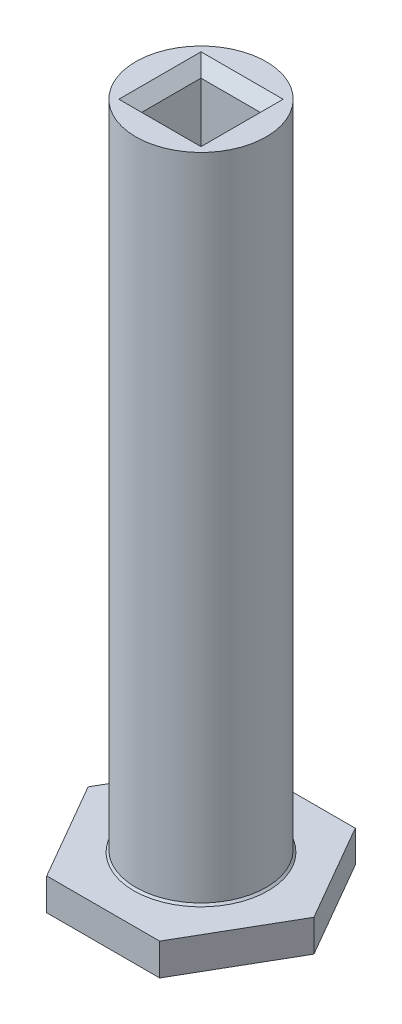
from build123d import *

# Parameters (mm, degrees)
KEY_DEPTH                     = 6.223
SKETCH2_R                     = 12.7
SHAFT_AND_WEIGHT_HOLDER_DEPTH = 127
SKETCH3_W                     = 11.557
SKETCH3_H                     = 11.557
F_8MM_SCREW_HOLE_DEPTH        = 15.875
CHAMFER1_SIZE                 = 0.381
CHAMFER2_SIZE                 = 2.2225


with BuildPart() as part:
    # Sketch1 → Key (new body)
    with BuildSketch(Plane(origin=(0, 0, 0), x_dir=(1, 0, 0), z_dir=(0, 1, 0))):
        Polygon((10.998522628, -19.05), (21.997045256, 0), (10.998522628, 19.05), (-10.998522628, 19.05), (-21.997045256, 0), (-10.998522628, -19.05), align=None)
    extrude(amount=KEY_DEPTH)


with BuildPart() as body_2:
    # Sketch2 → Shaft and Weight Holder (new body)
    with BuildSketch(Plane(origin=(0, 6.223, 0), x_dir=(1, 0, 0), z_dir=(0, 1, 0))):
        with Locations(Location((0, 0, 0), (0, 0, 270))):
            Circle(SKETCH2_R)
    extrude(amount=SHAFT_AND_WEIGHT_HOLDER_DEPTH)

    # Sketch3 → 8mm Screw Hole (cut)
    with BuildSketch(Plane(origin=(0, 133.223, 0), x_dir=(1, 0, 0), z_dir=(0, 1, 0))):
        Rectangle(SKETCH3_W, SKETCH3_H)
    extrude(amount=-F_8MM_SCREW_HOLE_DEPTH, mode=Mode.SUBTRACT)

    # Combine1: union part
    add(part.part)

    # Chamfer1
    chamfer1_edges = [body_2.edges().sort_by_distance(p)[0] for p in [
        (0, 6.223, -12.7),
    ]]
    chamfer(chamfer1_edges, length=CHAMFER1_SIZE)

    # Chamfer2
    chamfer2_edges = [body_2.edges().sort_by_distance(p)[0] for p in [
        (0, 133.223, -5.7785),
        (-5.7785, 133.223, 0),
        (0, 133.223, 5.7785),
        (5.7785, 133.223, 0),
    ]]
    chamfer(chamfer2_edges, length=CHAMFER2_SIZE)


solid = body_2.part
